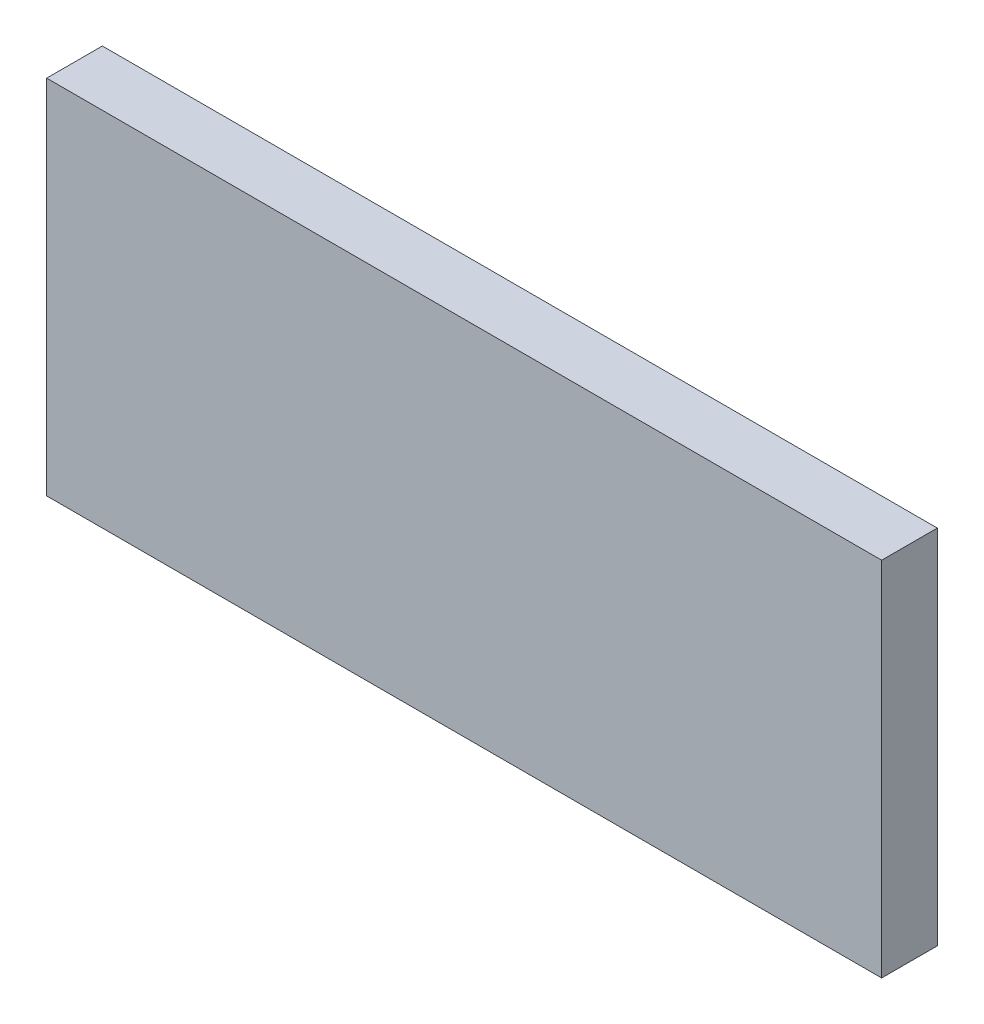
ISO-10303-21;
HEADER;
FILE_DESCRIPTION(('STEP AP214'),'2;1');
FILE_NAME('part.step','',(''),(''),'','','');
FILE_SCHEMA(('AUTOMOTIVE_DESIGN { 1 0 10303 214 1 1 1 1 }'));
ENDSEC;
DATA;
#1=APPLICATION_CONTEXT('core data for automotive mechanical design processes');
#2=APPLICATION_PROTOCOL_DEFINITION('international standard','automotive_design',2000,#1);
#3=PRODUCT_CONTEXT('',#1,'mechanical');
#4=PRODUCT('Part','Part','',(#3));
#5=PRODUCT_RELATED_PRODUCT_CATEGORY('part','',(#4));
#6=PRODUCT_DEFINITION_FORMATION('','',#4);
#7=PRODUCT_DEFINITION_CONTEXT('part definition',#1,'design');
#8=PRODUCT_DEFINITION('design','',#6,#7);
#9=PRODUCT_DEFINITION_SHAPE('','',#8);
#10=(LENGTH_UNIT() NAMED_UNIT(*) SI_UNIT(.MILLI.,.METRE.));
#11=(NAMED_UNIT(*) PLANE_ANGLE_UNIT() SI_UNIT($,.RADIAN.));
#12=(NAMED_UNIT(*) SI_UNIT($,.STERADIAN.) SOLID_ANGLE_UNIT());
#13=UNCERTAINTY_MEASURE_WITH_UNIT(LENGTH_MEASURE(1.E-05),#10,'distance_accuracy_value','');
#14=(GEOMETRIC_REPRESENTATION_CONTEXT(3) GLOBAL_UNCERTAINTY_ASSIGNED_CONTEXT((#13)) GLOBAL_UNIT_ASSIGNED_CONTEXT((#10,
#11,#12)) REPRESENTATION_CONTEXT('',''));
#15=CARTESIAN_POINT('',(0.,0.,0.));
#16=DIRECTION('',(0.,0.,1.));
#17=DIRECTION('',(1.,0.,0.));
#18=AXIS2_PLACEMENT_3D('',#15,#16,#17);
#19=CARTESIAN_POINT('',(0.,130.,0.));
#20=DIRECTION('',(-1.,0.,0.));
#21=DIRECTION('',(0.,0.,1.));
#22=AXIS2_PLACEMENT_3D('',#19,#20,#21);
#23=PLANE('',#22);
#24=DIRECTION('',(0.,0.,-1.));
#25=VECTOR('',#24,1.);
#26=CARTESIAN_POINT('',(0.,0.,0.));
#27=LINE('',#26,#25);
#28=CARTESIAN_POINT('',(0.,0.,20.));
#29=VERTEX_POINT('',#28);
#30=CARTESIAN_POINT('',(0.,0.,0.));
#31=VERTEX_POINT('',#30);
#32=EDGE_CURVE('E95',#29,#31,#27,.T.);
#33=ORIENTED_EDGE('',*,*,#32,.T.);
#34=DIRECTION('',(0.,-1.,0.));
#35=VECTOR('',#34,1.);
#36=CARTESIAN_POINT('',(0.,130.,0.));
#37=LINE('',#36,#35);
#38=CARTESIAN_POINT('',(0.,130.,0.));
#39=VERTEX_POINT('',#38);
#40=EDGE_CURVE('E11',#39,#31,#37,.T.);
#41=ORIENTED_EDGE('',*,*,#40,.F.);
#42=DIRECTION('',(0.,0.,-1.));
#43=VECTOR('',#42,1.);
#44=CARTESIAN_POINT('',(0.,130.,0.));
#45=LINE('',#44,#43);
#46=CARTESIAN_POINT('',(0.,130.,20.));
#47=VERTEX_POINT('',#46);
#48=EDGE_CURVE('E83',#47,#39,#45,.T.);
#49=ORIENTED_EDGE('',*,*,#48,.F.);
#50=DIRECTION('',(0.,-1.,0.));
#51=VECTOR('',#50,1.);
#52=CARTESIAN_POINT('',(0.,130.,20.));
#53=LINE('',#52,#51);
#54=EDGE_CURVE('E91',#47,#29,#53,.T.);
#55=ORIENTED_EDGE('',*,*,#54,.T.);
#56=EDGE_LOOP('',(#33,#41,#49,#55));
#57=FACE_BOUND('',#56,.T.);
#58=ADVANCED_FACE('F32',(#57),#23,.F.);
#59=CARTESIAN_POINT('',(0.,130.,0.));
#60=DIRECTION('',(0.,0.,1.));
#61=DIRECTION('',(1.,0.,0.));
#62=AXIS2_PLACEMENT_3D('',#59,#60,#61);
#63=PLANE('',#62);
#64=DIRECTION('',(-1.,0.,0.));
#65=VECTOR('',#64,1.);
#66=CARTESIAN_POINT('',(0.,0.,0.));
#67=LINE('',#66,#65);
#68=CARTESIAN_POINT('',(-300.,0.,0.));
#69=VERTEX_POINT('',#68);
#70=EDGE_CURVE('E87',#31,#69,#67,.T.);
#71=ORIENTED_EDGE('',*,*,#70,.T.);
#72=DIRECTION('',(0.,-1.,0.));
#73=VECTOR('',#72,1.);
#74=CARTESIAN_POINT('',(-300.,130.,0.));
#75=LINE('',#74,#73);
#76=CARTESIAN_POINT('',(-300.,130.,0.));
#77=VERTEX_POINT('',#76);
#78=EDGE_CURVE('E40',#77,#69,#75,.T.);
#79=ORIENTED_EDGE('',*,*,#78,.F.);
#80=DIRECTION('',(-1.,0.,0.));
#81=VECTOR('',#80,1.);
#82=CARTESIAN_POINT('',(0.,130.,0.));
#83=LINE('',#82,#81);
#84=EDGE_CURVE('E78',#39,#77,#83,.T.);
#85=ORIENTED_EDGE('',*,*,#84,.F.);
#86=ORIENTED_EDGE('',*,*,#40,.T.);
#87=EDGE_LOOP('',(#71,#79,#85,#86));
#88=FACE_BOUND('',#87,.T.);
#89=ADVANCED_FACE('F86',(#88),#63,.F.);
#90=CARTESIAN_POINT('',(-300.,130.,0.));
#91=DIRECTION('',(1.,0.,0.));
#92=DIRECTION('',(0.,0.,-1.));
#93=AXIS2_PLACEMENT_3D('',#90,#91,#92);
#94=PLANE('',#93);
#95=DIRECTION('',(0.,0.,1.));
#96=VECTOR('',#95,1.);
#97=CARTESIAN_POINT('',(-300.,0.,0.));
#98=LINE('',#97,#96);
#99=CARTESIAN_POINT('',(-300.,0.,20.0000000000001));
#100=VERTEX_POINT('',#99);
#101=EDGE_CURVE('E65',#69,#100,#98,.T.);
#102=ORIENTED_EDGE('',*,*,#101,.T.);
#103=DIRECTION('',(0.,-1.,0.));
#104=VECTOR('',#103,1.);
#105=CARTESIAN_POINT('',(-300.,130.,20.0000000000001));
#106=LINE('',#105,#104);
#107=CARTESIAN_POINT('',(-300.,130.,20.0000000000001));
#108=VERTEX_POINT('',#107);
#109=EDGE_CURVE('E88',#108,#100,#106,.T.);
#110=ORIENTED_EDGE('',*,*,#109,.F.);
#111=DIRECTION('',(0.,0.,1.));
#112=VECTOR('',#111,1.);
#113=CARTESIAN_POINT('',(-300.,130.,0.));
#114=LINE('',#113,#112);
#115=EDGE_CURVE('E81',#77,#108,#114,.T.);
#116=ORIENTED_EDGE('',*,*,#115,.F.);
#117=ORIENTED_EDGE('',*,*,#78,.T.);
#118=EDGE_LOOP('',(#102,#110,#116,#117));
#119=FACE_BOUND('',#118,.T.);
#120=ADVANCED_FACE('F89',(#119),#94,.F.);
#121=CARTESIAN_POINT('',(0.,130.,20.));
#122=DIRECTION('',(0.,0.,-1.));
#123=DIRECTION('',(-1.,0.,0.));
#124=AXIS2_PLACEMENT_3D('',#121,#122,#123);
#125=PLANE('',#124);
#126=DIRECTION('',(1.,0.,0.));
#127=VECTOR('',#126,1.);
#128=CARTESIAN_POINT('',(0.,0.,20.));
#129=LINE('',#128,#127);
#130=EDGE_CURVE('E71',#100,#29,#129,.T.);
#131=ORIENTED_EDGE('',*,*,#130,.T.);
#132=ORIENTED_EDGE('',*,*,#54,.F.);
#133=DIRECTION('',(1.,0.,0.));
#134=VECTOR('',#133,1.);
#135=CARTESIAN_POINT('',(0.,130.,20.));
#136=LINE('',#135,#134);
#137=EDGE_CURVE('E48',#108,#47,#136,.T.);
#138=ORIENTED_EDGE('',*,*,#137,.F.);
#139=ORIENTED_EDGE('',*,*,#109,.T.);
#140=EDGE_LOOP('',(#131,#132,#138,#139));
#141=FACE_BOUND('',#140,.T.);
#142=ADVANCED_FACE('F102',(#141),#125,.F.);
#143=CARTESIAN_POINT('',(0.,130.,0.));
#144=DIRECTION('',(0.,-1.,0.));
#145=DIRECTION('',(0.,0.,-1.));
#146=AXIS2_PLACEMENT_3D('',#143,#144,#145);
#147=PLANE('',#146);
#148=ORIENTED_EDGE('',*,*,#48,.T.);
#149=ORIENTED_EDGE('',*,*,#84,.T.);
#150=ORIENTED_EDGE('',*,*,#115,.T.);
#151=ORIENTED_EDGE('',*,*,#137,.T.);
#152=EDGE_LOOP('',(#148,#149,#150,#151));
#153=FACE_BOUND('',#152,.T.);
#154=ADVANCED_FACE('F79',(#153),#147,.F.);
#155=CARTESIAN_POINT('',(0.,0.,0.));
#156=DIRECTION('',(0.,-1.,0.));
#157=DIRECTION('',(0.,0.,-1.));
#158=AXIS2_PLACEMENT_3D('',#155,#156,#157);
#159=PLANE('',#158);
#160=ORIENTED_EDGE('',*,*,#32,.F.);
#161=ORIENTED_EDGE('',*,*,#130,.F.);
#162=ORIENTED_EDGE('',*,*,#101,.F.);
#163=ORIENTED_EDGE('',*,*,#70,.F.);
#164=EDGE_LOOP('',(#160,#161,#162,#163));
#165=FACE_BOUND('',#164,.T.);
#166=ADVANCED_FACE('F105',(#165),#159,.T.);
#167=CLOSED_SHELL('',(#58,#89,#120,#142,#154,#166));
#168=MANIFOLD_SOLID_BREP('B2',#167);
#169=ADVANCED_BREP_SHAPE_REPRESENTATION('',(#18,#168),#14);
#170=SHAPE_DEFINITION_REPRESENTATION(#9,#169);
ENDSEC;
END-ISO-10303-21;
